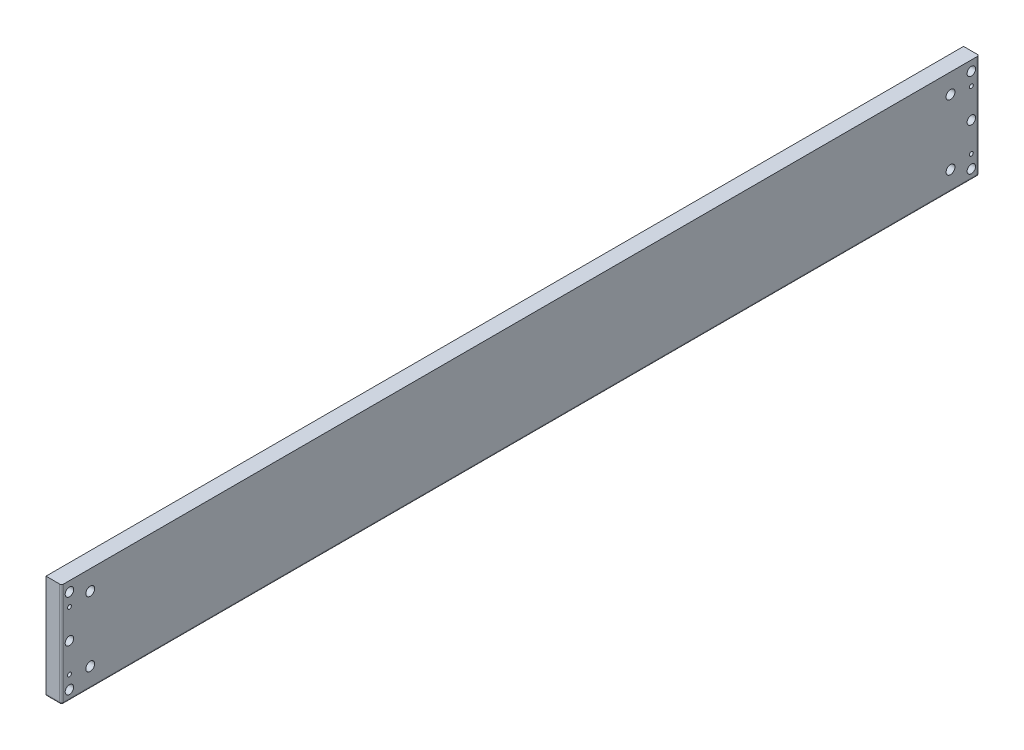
ISO-10303-21;
HEADER;
FILE_DESCRIPTION(('STEP AP214'),'2;1');
FILE_NAME('part.step','',(''),(''),'','','');
FILE_SCHEMA(('AUTOMOTIVE_DESIGN { 1 0 10303 214 1 1 1 1 }'));
ENDSEC;
DATA;
#1=APPLICATION_CONTEXT('core data for automotive mechanical design processes');
#2=APPLICATION_PROTOCOL_DEFINITION('international standard','automotive_design',2000,#1);
#3=PRODUCT_CONTEXT('',#1,'mechanical');
#4=PRODUCT('Part','Part','',(#3));
#5=PRODUCT_RELATED_PRODUCT_CATEGORY('part','',(#4));
#6=PRODUCT_DEFINITION_FORMATION('','',#4);
#7=PRODUCT_DEFINITION_CONTEXT('part definition',#1,'design');
#8=PRODUCT_DEFINITION('design','',#6,#7);
#9=PRODUCT_DEFINITION_SHAPE('','',#8);
#10=(LENGTH_UNIT() NAMED_UNIT(*) SI_UNIT(.MILLI.,.METRE.));
#11=(NAMED_UNIT(*) PLANE_ANGLE_UNIT() SI_UNIT($,.RADIAN.));
#12=(NAMED_UNIT(*) SI_UNIT($,.STERADIAN.) SOLID_ANGLE_UNIT());
#13=UNCERTAINTY_MEASURE_WITH_UNIT(LENGTH_MEASURE(1.E-05),#10,'distance_accuracy_value','');
#14=(GEOMETRIC_REPRESENTATION_CONTEXT(3) GLOBAL_UNCERTAINTY_ASSIGNED_CONTEXT((#13)) GLOBAL_UNIT_ASSIGNED_CONTEXT((#10,
#11,#12)) REPRESENTATION_CONTEXT('',''));
#15=CARTESIAN_POINT('',(0.,0.,0.));
#16=DIRECTION('',(0.,0.,1.));
#17=DIRECTION('',(1.,0.,0.));
#18=AXIS2_PLACEMENT_3D('',#15,#16,#17);
#19=CARTESIAN_POINT('',(4.50000000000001,-38.5,352.5));
#20=DIRECTION('',(0.,0.,-1.));
#21=DIRECTION('',(-1.,0.,0.));
#22=AXIS2_PLACEMENT_3D('',#19,#20,#21);
#23=CYLINDRICAL_SURFACE('',#22,1.5);
#24=CARTESIAN_POINT('',(4.50000000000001,-38.5,351.));
#25=DIRECTION('',(0.,0.,-1.));
#26=DIRECTION('',(1.,0.,0.));
#27=AXIS2_PLACEMENT_3D('',#24,#25,#26);
#28=CIRCLE('',#27,1.5);
#29=CARTESIAN_POINT('',(4.50000000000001,-40.,351.));
#30=VERTEX_POINT('',#29);
#31=CARTESIAN_POINT('',(6.00000000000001,-38.5,351.));
#32=VERTEX_POINT('',#31);
#33=EDGE_CURVE('E144',#30,#32,#28,.F.);
#34=ORIENTED_EDGE('',*,*,#33,.F.);
#35=DIRECTION('',(0.,0.,1.));
#36=VECTOR('',#35,1.);
#37=CARTESIAN_POINT('',(4.50000000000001,-40.,352.5));
#38=LINE('',#37,#36);
#39=CARTESIAN_POINT('',(4.50000000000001,-40.,-350.999999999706));
#40=VERTEX_POINT('',#39);
#41=EDGE_CURVE('E123',#30,#40,#38,.F.);
#42=ORIENTED_EDGE('',*,*,#41,.T.);
#43=CARTESIAN_POINT('',(4.50000000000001,-38.5,-351.));
#44=DIRECTION('',(0.,-7.85038884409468E-10,-1.));
#45=DIRECTION('',(1.,0.,0.));
#46=AXIS2_PLACEMENT_3D('',#43,#44,#45);
#47=CIRCLE('',#46,1.5);
#48=CARTESIAN_POINT('',(6.00000000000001,-38.5,-351.));
#49=VERTEX_POINT('',#48);
#50=EDGE_CURVE('E150',#49,#40,#47,.T.);
#51=ORIENTED_EDGE('',*,*,#50,.F.);
#52=DIRECTION('',(0.,0.,1.));
#53=VECTOR('',#52,1.);
#54=CARTESIAN_POINT('',(6.00000000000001,-38.5,352.5));
#55=LINE('',#54,#53);
#56=EDGE_CURVE('E145',#49,#32,#55,.T.);
#57=ORIENTED_EDGE('',*,*,#56,.T.);
#58=EDGE_LOOP('',(#34,#42,#51,#57));
#59=FACE_BOUND('',#58,.T.);
#60=ADVANCED_FACE('F16',(#59),#23,.T.);
#61=CARTESIAN_POINT('',(4.50000000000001,-38.5,351.));
#62=DIRECTION('',(1.,0.,0.));
#63=DIRECTION('',(0.,0.,-1.));
#64=AXIS2_PLACEMENT_3D('',#61,#62,#63);
#65=SPHERICAL_SURFACE('',#64,1.5);
#66=ORIENTED_EDGE('',*,*,#33,.T.);
#67=CARTESIAN_POINT('',(4.50000000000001,-38.5,351.));
#68=DIRECTION('',(0.,-1.,0.));
#69=DIRECTION('',(1.,0.,0.));
#70=AXIS2_PLACEMENT_3D('',#67,#68,#69);
#71=CIRCLE('',#70,1.5);
#72=CARTESIAN_POINT('',(4.50000000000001,-38.5,352.5));
#73=VERTEX_POINT('',#72);
#74=EDGE_CURVE('E153',#73,#32,#71,.F.);
#75=ORIENTED_EDGE('',*,*,#74,.F.);
#76=CARTESIAN_POINT('',(4.50000000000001,-38.5,351.));
#77=DIRECTION('',(-1.,0.,0.));
#78=DIRECTION('',(0.,0.,1.));
#79=AXIS2_PLACEMENT_3D('',#76,#77,#78);
#80=CIRCLE('',#79,1.5);
#81=EDGE_CURVE('E139',#30,#73,#80,.T.);
#82=ORIENTED_EDGE('',*,*,#81,.F.);
#83=EDGE_LOOP('',(#66,#75,#82));
#84=FACE_BOUND('',#83,.T.);
#85=ADVANCED_FACE('F152',(#84),#65,.T.);
#86=CARTESIAN_POINT('',(4.50000000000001,-38.5,-351.));
#87=DIRECTION('',(1.,0.,0.));
#88=DIRECTION('',(0.,0.,-1.));
#89=AXIS2_PLACEMENT_3D('',#86,#87,#88);
#90=SPHERICAL_SURFACE('',#89,1.5);
#91=CARTESIAN_POINT('',(4.50000000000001,-38.5,-351.));
#92=DIRECTION('',(0.,1.,0.));
#93=DIRECTION('',(-1.,0.,0.));
#94=AXIS2_PLACEMENT_3D('',#91,#92,#93);
#95=CIRCLE('',#94,1.5);
#96=CARTESIAN_POINT('',(4.50000000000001,-38.5,-352.5));
#97=VERTEX_POINT('',#96);
#98=EDGE_CURVE('E68',#49,#97,#95,.T.);
#99=ORIENTED_EDGE('',*,*,#98,.F.);
#100=ORIENTED_EDGE('',*,*,#50,.T.);
#101=CARTESIAN_POINT('',(4.50000000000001,-38.5,-351.));
#102=DIRECTION('',(1.,0.,0.));
#103=DIRECTION('',(0.,0.,-1.));
#104=AXIS2_PLACEMENT_3D('',#101,#102,#103);
#105=CIRCLE('',#104,1.5);
#106=EDGE_CURVE('E155',#97,#40,#105,.F.);
#107=ORIENTED_EDGE('',*,*,#106,.F.);
#108=EDGE_LOOP('',(#99,#100,#107));
#109=FACE_BOUND('',#108,.T.);
#110=ADVANCED_FACE('F211',(#109),#90,.T.);
#111=CARTESIAN_POINT('',(4.50000000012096,22.5,300.));
#112=DIRECTION('',(-1.,0.,0.));
#113=DIRECTION('',(0.,0.,1.));
#114=AXIS2_PLACEMENT_3D('',#111,#112,#113);
#115=CONICAL_SURFACE('',#114,1.64999999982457,1.04719755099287);
#116=CARTESIAN_POINT('',(5.45262794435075,22.5,299.999999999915));
#117=VERTEX_POINT('',#116);
#118=VERTEX_LOOP('',#117);
#119=FACE_BOUND('',#118,.T.);
#120=CARTESIAN_POINT('',(4.5,22.5,300.));
#121=DIRECTION('',(-1.,0.,0.));
#122=DIRECTION('',(0.,0.,1.));
#123=AXIS2_PLACEMENT_3D('',#120,#121,#122);
#124=CIRCLE('',#123,1.64999999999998);
#125=CARTESIAN_POINT('',(4.5,22.5,301.65));
#126=VERTEX_POINT('',#125);
#127=EDGE_CURVE('E203',#126,#126,#124,.T.);
#128=ORIENTED_EDGE('',*,*,#127,.T.);
#129=EDGE_LOOP('',(#128));
#130=FACE_BOUND('',#129,.T.);
#131=ADVANCED_FACE('F214',(#119,#130),#115,.F.);
#132=CARTESIAN_POINT('',(4.50000000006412,22.4999999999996,240.));
#133=DIRECTION('',(-1.,0.,0.));
#134=DIRECTION('',(0.,0.,1.));
#135=AXIS2_PLACEMENT_3D('',#132,#133,#134);
#136=CONICAL_SURFACE('',#135,1.64999999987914,1.04719755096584);
#137=CARTESIAN_POINT('',(5.45262794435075,22.4999999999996,239.999999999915));
#138=VERTEX_POINT('',#137);
#139=VERTEX_LOOP('',#138);
#140=FACE_BOUND('',#139,.T.);
#141=CARTESIAN_POINT('',(4.5,22.4999999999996,240.));
#142=DIRECTION('',(-1.,0.,0.));
#143=DIRECTION('',(0.,0.,1.));
#144=AXIS2_PLACEMENT_3D('',#141,#142,#143);
#145=CIRCLE('',#144,1.64999999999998);
#146=CARTESIAN_POINT('',(4.5,22.4999999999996,241.65));
#147=VERTEX_POINT('',#146);
#148=EDGE_CURVE('E200',#147,#147,#145,.T.);
#149=ORIENTED_EDGE('',*,*,#148,.T.);
#150=EDGE_LOOP('',(#149));
#151=FACE_BOUND('',#150,.T.);
#152=ADVANCED_FACE('F887',(#140,#151),#136,.F.);
#153=CARTESIAN_POINT('',(4.50000000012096,22.4999999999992,180.));
#154=DIRECTION('',(-1.,0.,0.));
#155=DIRECTION('',(0.,0.,1.));
#156=AXIS2_PLACEMENT_3D('',#153,#154,#155);
#157=CONICAL_SURFACE('',#156,1.64999999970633,1.04719755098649);
#158=CARTESIAN_POINT('',(5.45262794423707,22.4999999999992,180.000000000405));
#159=VERTEX_POINT('',#158);
#160=VERTEX_LOOP('',#159);
#161=FACE_BOUND('',#160,.T.);
#162=CARTESIAN_POINT('',(4.5,22.4999999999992,180.));
#163=DIRECTION('',(-1.,0.,0.));
#164=DIRECTION('',(0.,0.,1.));
#165=AXIS2_PLACEMENT_3D('',#162,#163,#164);
#166=CIRCLE('',#165,1.64999999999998);
#167=CARTESIAN_POINT('',(4.5,22.4999999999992,181.65));
#168=VERTEX_POINT('',#167);
#169=EDGE_CURVE('E197',#168,#168,#166,.T.);
#170=ORIENTED_EDGE('',*,*,#169,.T.);
#171=EDGE_LOOP('',(#170));
#172=FACE_BOUND('',#171,.T.);
#173=ADVANCED_FACE('F878',(#161,#172),#157,.F.);
#174=CARTESIAN_POINT('',(4.50000000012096,22.4999999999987,120.));
#175=DIRECTION('',(-1.,0.,0.));
#176=DIRECTION('',(0.,0.,1.));
#177=AXIS2_PLACEMENT_3D('',#174,#175,#176);
#178=CONICAL_SURFACE('',#177,1.64999999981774,1.04719755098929);
#179=CARTESIAN_POINT('',(5.45262794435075,22.4999999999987,119.999999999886));
#180=VERTEX_POINT('',#179);
#181=VERTEX_LOOP('',#180);
#182=FACE_BOUND('',#181,.T.);
#183=CARTESIAN_POINT('',(4.5,22.4999999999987,120.));
#184=DIRECTION('',(-1.,0.,0.));
#185=DIRECTION('',(0.,0.,1.));
#186=AXIS2_PLACEMENT_3D('',#183,#184,#185);
#187=CIRCLE('',#186,1.64999999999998);
#188=CARTESIAN_POINT('',(4.5,22.4999999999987,121.65));
#189=VERTEX_POINT('',#188);
#190=EDGE_CURVE('E194',#189,#189,#187,.T.);
#191=ORIENTED_EDGE('',*,*,#190,.T.);
#192=EDGE_LOOP('',(#191));
#193=FACE_BOUND('',#192,.T.);
#194=ADVANCED_FACE('F869',(#182,#193),#178,.F.);
#195=CARTESIAN_POINT('',(4.50000000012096,22.4999999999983,60.));
#196=DIRECTION('',(-1.,0.,0.));
#197=DIRECTION('',(0.,0.,1.));
#198=AXIS2_PLACEMENT_3D('',#195,#196,#197);
#199=CONICAL_SURFACE('',#198,1.64999999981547,1.04719755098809);
#200=CARTESIAN_POINT('',(5.45262794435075,22.4999999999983,59.9999999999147));
#201=VERTEX_POINT('',#200);
#202=VERTEX_LOOP('',#201);
#203=FACE_BOUND('',#202,.T.);
#204=CARTESIAN_POINT('',(4.5,22.4999999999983,60.));
#205=DIRECTION('',(-1.,0.,0.));
#206=DIRECTION('',(0.,0.,1.));
#207=AXIS2_PLACEMENT_3D('',#204,#205,#206);
#208=CIRCLE('',#207,1.64999999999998);
#209=CARTESIAN_POINT('',(4.5,22.4999999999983,61.65));
#210=VERTEX_POINT('',#209);
#211=EDGE_CURVE('E191',#210,#210,#208,.T.);
#212=ORIENTED_EDGE('',*,*,#211,.T.);
#213=EDGE_LOOP('',(#212));
#214=FACE_BOUND('',#213,.T.);
#215=ADVANCED_FACE('F860',(#203,#214),#199,.F.);
#216=CARTESIAN_POINT('',(4.50000000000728,22.4999999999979,0.));
#217=DIRECTION('',(-1.,0.,0.));
#218=DIRECTION('',(0.,0.,1.));
#219=AXIS2_PLACEMENT_3D('',#216,#217,#218);
#220=CONICAL_SURFACE('',#219,1.64999999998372,1.04719755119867);
#221=CARTESIAN_POINT('',(5.45262794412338,22.4999999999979,0.));
#222=VERTEX_POINT('',#221);
#223=VERTEX_LOOP('',#222);
#224=FACE_BOUND('',#223,.T.);
#225=CARTESIAN_POINT('',(4.5,22.4999999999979,0.));
#226=DIRECTION('',(-1.,0.,0.));
#227=DIRECTION('',(0.,0.,1.));
#228=AXIS2_PLACEMENT_3D('',#225,#226,#227);
#229=CIRCLE('',#228,1.64999999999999);
#230=CARTESIAN_POINT('',(4.5,22.4999999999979,1.64999999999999));
#231=VERTEX_POINT('',#230);
#232=EDGE_CURVE('E188',#231,#231,#229,.T.);
#233=ORIENTED_EDGE('',*,*,#232,.T.);
#234=EDGE_LOOP('',(#233));
#235=FACE_BOUND('',#234,.T.);
#236=ADVANCED_FACE('F851',(#224,#235),#220,.F.);
#237=CARTESIAN_POINT('',(4.50000000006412,22.4999999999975,-60.));
#238=DIRECTION('',(-1.,0.,0.));
#239=DIRECTION('',(0.,0.,1.));
#240=AXIS2_PLACEMENT_3D('',#237,#238,#239);
#241=CONICAL_SURFACE('',#240,1.64999999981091,1.04719755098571);
#242=CARTESIAN_POINT('',(5.45262794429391,22.4999999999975,-60.0000000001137));
#243=VERTEX_POINT('',#242);
#244=VERTEX_LOOP('',#243);
#245=FACE_BOUND('',#244,.T.);
#246=CARTESIAN_POINT('',(4.5,22.4999999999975,-60.));
#247=DIRECTION('',(-1.,0.,0.));
#248=DIRECTION('',(0.,0.,1.));
#249=AXIS2_PLACEMENT_3D('',#246,#247,#248);
#250=CIRCLE('',#249,1.64999999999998);
#251=CARTESIAN_POINT('',(4.5,22.4999999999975,-58.35));
#252=VERTEX_POINT('',#251);
#253=EDGE_CURVE('E185',#252,#252,#250,.T.);
#254=ORIENTED_EDGE('',*,*,#253,.T.);
#255=EDGE_LOOP('',(#254));
#256=FACE_BOUND('',#255,.T.);
#257=ADVANCED_FACE('F842',(#245,#256),#241,.F.);
#258=CARTESIAN_POINT('',(4.50000000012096,22.4999999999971,-120.));
#259=DIRECTION('',(-1.,0.,0.));
#260=DIRECTION('',(0.,0.,1.));
#261=AXIS2_PLACEMENT_3D('',#258,#259,#260);
#262=CONICAL_SURFACE('',#261,1.64999999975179,1.04719755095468);
#263=CARTESIAN_POINT('',(5.45262794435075,22.4999999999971,-120.000000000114));
#264=VERTEX_POINT('',#263);
#265=VERTEX_LOOP('',#264);
#266=FACE_BOUND('',#265,.T.);
#267=CARTESIAN_POINT('',(4.5,22.4999999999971,-120.));
#268=DIRECTION('',(-1.,0.,0.));
#269=DIRECTION('',(0.,0.,1.));
#270=AXIS2_PLACEMENT_3D('',#267,#268,#269);
#271=CIRCLE('',#270,1.64999999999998);
#272=CARTESIAN_POINT('',(4.5,22.4999999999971,-118.35));
#273=VERTEX_POINT('',#272);
#274=EDGE_CURVE('E182',#273,#273,#271,.T.);
#275=ORIENTED_EDGE('',*,*,#274,.T.);
#276=EDGE_LOOP('',(#275));
#277=FACE_BOUND('',#276,.T.);
#278=ADVANCED_FACE('F833',(#266,#277),#262,.F.);
#279=CARTESIAN_POINT('',(4.50000000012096,22.4999999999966,-180.));
#280=DIRECTION('',(-1.,0.,0.));
#281=DIRECTION('',(0.,0.,1.));
#282=AXIS2_PLACEMENT_3D('',#279,#280,#281);
#283=CONICAL_SURFACE('',#282,1.64999999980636,1.04719755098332);
#284=CARTESIAN_POINT('',(5.45262794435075,22.4999999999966,-180.000000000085));
#285=VERTEX_POINT('',#284);
#286=VERTEX_LOOP('',#285);
#287=FACE_BOUND('',#286,.T.);
#288=CARTESIAN_POINT('',(4.5,22.4999999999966,-180.));
#289=DIRECTION('',(-1.,0.,0.));
#290=DIRECTION('',(0.,0.,1.));
#291=AXIS2_PLACEMENT_3D('',#288,#289,#290);
#292=CIRCLE('',#291,1.64999999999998);
#293=CARTESIAN_POINT('',(4.5,22.4999999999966,-178.35));
#294=VERTEX_POINT('',#293);
#295=EDGE_CURVE('E179',#294,#294,#292,.T.);
#296=ORIENTED_EDGE('',*,*,#295,.T.);
#297=EDGE_LOOP('',(#296));
#298=FACE_BOUND('',#297,.T.);
#299=ADVANCED_FACE('F824',(#287,#298),#283,.F.);
#300=CARTESIAN_POINT('',(4.50000000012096,22.4999999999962,-240.));
#301=DIRECTION('',(-1.,0.,0.));
#302=DIRECTION('',(0.,0.,1.));
#303=AXIS2_PLACEMENT_3D('',#300,#301,#302);
#304=CONICAL_SURFACE('',#303,1.64999999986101,1.04719755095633);
#305=CARTESIAN_POINT('',(5.4526279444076,22.4999999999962,-240.000000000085));
#306=VERTEX_POINT('',#305);
#307=VERTEX_LOOP('',#306);
#308=FACE_BOUND('',#307,.T.);
#309=CARTESIAN_POINT('',(4.5,22.4999999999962,-240.));
#310=DIRECTION('',(-1.,0.,0.));
#311=DIRECTION('',(0.,0.,1.));
#312=AXIS2_PLACEMENT_3D('',#309,#310,#311);
#313=CIRCLE('',#312,1.64999999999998);
#314=CARTESIAN_POINT('',(4.5,22.4999999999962,-238.35));
#315=VERTEX_POINT('',#314);
#316=EDGE_CURVE('E176',#315,#315,#313,.T.);
#317=ORIENTED_EDGE('',*,*,#316,.T.);
#318=EDGE_LOOP('',(#317));
#319=FACE_BOUND('',#318,.T.);
#320=ADVANCED_FACE('F815',(#308,#319),#304,.F.);
#321=CARTESIAN_POINT('',(4.50000000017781,22.4999999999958,-300.));
#322=DIRECTION('',(-1.,0.,0.));
#323=DIRECTION('',(0.,0.,1.));
#324=AXIS2_PLACEMENT_3D('',#321,#322,#323);
#325=CONICAL_SURFACE('',#324,1.64999999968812,1.04719755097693);
#326=CARTESIAN_POINT('',(5.45262794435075,22.4999999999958,-300.000000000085));
#327=VERTEX_POINT('',#326);
#328=VERTEX_LOOP('',#327);
#329=FACE_BOUND('',#328,.T.);
#330=CARTESIAN_POINT('',(4.5,22.4999999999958,-300.));
#331=DIRECTION('',(-1.,0.,0.));
#332=DIRECTION('',(0.,0.,1.));
#333=AXIS2_PLACEMENT_3D('',#330,#331,#332);
#334=CIRCLE('',#333,1.64999999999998);
#335=CARTESIAN_POINT('',(4.5,22.4999999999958,-298.35));
#336=VERTEX_POINT('',#335);
#337=EDGE_CURVE('E172',#336,#336,#334,.T.);
#338=ORIENTED_EDGE('',*,*,#337,.T.);
#339=EDGE_LOOP('',(#338));
#340=FACE_BOUND('',#339,.T.);
#341=ADVANCED_FACE('F806',(#329,#340),#325,.F.);
#342=CARTESIAN_POINT('',(6.,40.,352.5));
#343=DIRECTION('',(-1.,0.,0.));
#344=DIRECTION('',(0.,-1.,0.));
#345=AXIS2_PLACEMENT_3D('',#342,#343,#344);
#346=PLANE('',#345);
#347=CARTESIAN_POINT('',(6.00000000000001,32.5,-346.5));
#348=DIRECTION('',(-1.,0.,0.));
#349=DIRECTION('',(0.,-1.,0.));
#350=AXIS2_PLACEMENT_3D('',#347,#348,#349);
#351=CIRCLE('',#350,3.24999999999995);
#352=CARTESIAN_POINT('',(6.00000000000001,29.25,-346.5));
#353=VERTEX_POINT('',#352);
#354=EDGE_CURVE('E314',#353,#353,#351,.T.);
#355=ORIENTED_EDGE('',*,*,#354,.T.);
#356=EDGE_LOOP('',(#355));
#357=FACE_BOUND('',#356,.T.);
#358=CARTESIAN_POINT('',(6.00000000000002,-32.5,-346.5));
#359=DIRECTION('',(-1.,0.,0.));
#360=DIRECTION('',(0.,-1.,0.));
#361=AXIS2_PLACEMENT_3D('',#358,#359,#360);
#362=CIRCLE('',#361,3.24999999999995);
#363=CARTESIAN_POINT('',(6.00000000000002,-35.75,-346.5));
#364=VERTEX_POINT('',#363);
#365=EDGE_CURVE('E317',#364,#364,#362,.T.);
#366=ORIENTED_EDGE('',*,*,#365,.T.);
#367=EDGE_LOOP('',(#366));
#368=FACE_BOUND('',#367,.T.);
#369=CARTESIAN_POINT('',(6.00000000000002,-32.4999999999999,346.5));
#370=DIRECTION('',(-1.,0.,0.));
#371=DIRECTION('',(0.,-1.,0.));
#372=AXIS2_PLACEMENT_3D('',#369,#370,#371);
#373=CIRCLE('',#372,3.24999999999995);
#374=CARTESIAN_POINT('',(6.00000000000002,-35.7499999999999,346.5));
#375=VERTEX_POINT('',#374);
#376=EDGE_CURVE('E320',#375,#375,#373,.T.);
#377=ORIENTED_EDGE('',*,*,#376,.T.);
#378=EDGE_LOOP('',(#377));
#379=FACE_BOUND('',#378,.T.);
#380=CARTESIAN_POINT('',(6.00000000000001,32.4999999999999,346.5));
#381=DIRECTION('',(-1.,0.,0.));
#382=DIRECTION('',(0.,-1.,0.));
#383=AXIS2_PLACEMENT_3D('',#380,#381,#382);
#384=CIRCLE('',#383,3.24999999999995);
#385=CARTESIAN_POINT('',(6.00000000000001,29.25,346.5));
#386=VERTEX_POINT('',#385);
#387=EDGE_CURVE('E323',#386,#386,#384,.T.);
#388=ORIENTED_EDGE('',*,*,#387,.T.);
#389=EDGE_LOOP('',(#388));
#390=FACE_BOUND('',#389,.T.);
#391=CARTESIAN_POINT('',(6.00000000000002,0.,-346.5));
#392=DIRECTION('',(-1.,0.,0.));
#393=DIRECTION('',(0.,-1.,0.));
#394=AXIS2_PLACEMENT_3D('',#391,#392,#393);
#395=CIRCLE('',#394,3.24999999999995);
#396=CARTESIAN_POINT('',(6.00000000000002,-3.24999999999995,-346.5));
#397=VERTEX_POINT('',#396);
#398=EDGE_CURVE('E326',#397,#397,#395,.T.);
#399=ORIENTED_EDGE('',*,*,#398,.T.);
#400=EDGE_LOOP('',(#399));
#401=FACE_BOUND('',#400,.T.);
#402=CARTESIAN_POINT('',(6.00000000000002,0.,346.5));
#403=DIRECTION('',(-1.,0.,0.));
#404=DIRECTION('',(0.,-1.,0.));
#405=AXIS2_PLACEMENT_3D('',#402,#403,#404);
#406=CIRCLE('',#405,3.24999999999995);
#407=CARTESIAN_POINT('',(6.00000000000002,-3.24999999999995,346.5));
#408=VERTEX_POINT('',#407);
#409=EDGE_CURVE('E329',#408,#408,#406,.T.);
#410=ORIENTED_EDGE('',*,*,#409,.T.);
#411=EDGE_LOOP('',(#410));
#412=FACE_BOUND('',#411,.T.);
#413=DIRECTION('',(0.,-1.,0.));
#414=VECTOR('',#413,1.);
#415=CARTESIAN_POINT('',(6.00000000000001,-40.,351.));
#416=LINE('',#415,#414);
#417=CARTESIAN_POINT('',(6.,40.,351.));
#418=VERTEX_POINT('',#417);
#419=EDGE_CURVE('E133',#32,#418,#416,.F.);
#420=ORIENTED_EDGE('',*,*,#419,.F.);
#421=ORIENTED_EDGE('',*,*,#56,.F.);
#422=DIRECTION('',(0.,1.,0.));
#423=VECTOR('',#422,1.);
#424=CARTESIAN_POINT('',(6.,40.,-351.));
#425=LINE('',#424,#423);
#426=CARTESIAN_POINT('',(6.,40.,-351.));
#427=VERTEX_POINT('',#426);
#428=EDGE_CURVE('E168',#427,#49,#425,.F.);
#429=ORIENTED_EDGE('',*,*,#428,.F.);
#430=DIRECTION('',(0.,0.,-1.));
#431=VECTOR('',#430,1.);
#432=CARTESIAN_POINT('',(6.,40.,352.5));
#433=LINE('',#432,#431);
#434=EDGE_CURVE('E312',#427,#418,#433,.F.);
#435=ORIENTED_EDGE('',*,*,#434,.T.);
#436=EDGE_LOOP('',(#420,#421,#429,#435));
#437=FACE_BOUND('',#436,.T.);
#438=CARTESIAN_POINT('',(6.00000000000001,-25.,330.5));
#439=DIRECTION('',(1.,0.,0.));
#440=DIRECTION('',(0.,0.,-1.));
#441=AXIS2_PLACEMENT_3D('',#438,#439,#440);
#442=CIRCLE('',#441,3.40000000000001);
#443=CARTESIAN_POINT('',(6.00000000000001,-25.,327.1));
#444=VERTEX_POINT('',#443);
#445=EDGE_CURVE('E332',#444,#444,#442,.F.);
#446=ORIENTED_EDGE('',*,*,#445,.T.);
#447=EDGE_LOOP('',(#446));
#448=FACE_BOUND('',#447,.T.);
#449=CARTESIAN_POINT('',(6.,25.,330.5));
#450=DIRECTION('',(1.,0.,0.));
#451=DIRECTION('',(0.,0.,-1.));
#452=AXIS2_PLACEMENT_3D('',#449,#450,#451);
#453=CIRCLE('',#452,3.40000000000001);
#454=CARTESIAN_POINT('',(6.,25.,327.1));
#455=VERTEX_POINT('',#454);
#456=EDGE_CURVE('E335',#455,#455,#453,.F.);
#457=ORIENTED_EDGE('',*,*,#456,.T.);
#458=EDGE_LOOP('',(#457));
#459=FACE_BOUND('',#458,.T.);
#460=CARTESIAN_POINT('',(6.,25.,-330.5));
#461=DIRECTION('',(1.,0.,0.));
#462=DIRECTION('',(0.,0.,-1.));
#463=AXIS2_PLACEMENT_3D('',#460,#461,#462);
#464=CIRCLE('',#463,3.40000000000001);
#465=CARTESIAN_POINT('',(6.,25.,-333.9));
#466=VERTEX_POINT('',#465);
#467=EDGE_CURVE('E338',#466,#466,#464,.F.);
#468=ORIENTED_EDGE('',*,*,#467,.T.);
#469=EDGE_LOOP('',(#468));
#470=FACE_BOUND('',#469,.T.);
#471=CARTESIAN_POINT('',(6.00000000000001,-25.,-330.5));
#472=DIRECTION('',(1.,0.,0.));
#473=DIRECTION('',(0.,0.,-1.));
#474=AXIS2_PLACEMENT_3D('',#471,#472,#473);
#475=CIRCLE('',#474,3.40000000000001);
#476=CARTESIAN_POINT('',(6.00000000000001,-25.,-333.9));
#477=VERTEX_POINT('',#476);
#478=EDGE_CURVE('E175',#477,#477,#475,.F.);
#479=ORIENTED_EDGE('',*,*,#478,.T.);
#480=EDGE_LOOP('',(#479));
#481=FACE_BOUND('',#480,.T.);
#482=CARTESIAN_POINT('',(6.,22.5,346.5));
#483=DIRECTION('',(1.,0.,0.));
#484=DIRECTION('',(0.,1.,0.));
#485=AXIS2_PLACEMENT_3D('',#482,#483,#484);
#486=CIRCLE('',#485,1.50000000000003);
#487=CARTESIAN_POINT('',(6.,24.,346.5));
#488=VERTEX_POINT('',#487);
#489=EDGE_CURVE('E206',#488,#488,#486,.F.);
#490=ORIENTED_EDGE('',*,*,#489,.T.);
#491=EDGE_LOOP('',(#490));
#492=FACE_BOUND('',#491,.T.);
#493=CARTESIAN_POINT('',(6.00000000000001,-22.5,346.5));
#494=DIRECTION('',(1.,0.,0.));
#495=DIRECTION('',(0.,1.,0.));
#496=AXIS2_PLACEMENT_3D('',#493,#494,#495);
#497=CIRCLE('',#496,1.50000000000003);
#498=CARTESIAN_POINT('',(6.00000000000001,-21.,346.5));
#499=VERTEX_POINT('',#498);
#500=EDGE_CURVE('E345',#499,#499,#497,.F.);
#501=ORIENTED_EDGE('',*,*,#500,.T.);
#502=EDGE_LOOP('',(#501));
#503=FACE_BOUND('',#502,.T.);
#504=CARTESIAN_POINT('',(6.00000000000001,-22.5,-346.5));
#505=DIRECTION('',(1.,0.,0.));
#506=DIRECTION('',(0.,1.,0.));
#507=AXIS2_PLACEMENT_3D('',#504,#505,#506);
#508=CIRCLE('',#507,1.50000000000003);
#509=CARTESIAN_POINT('',(6.00000000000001,-21.,-346.5));
#510=VERTEX_POINT('',#509);
#511=EDGE_CURVE('E347',#510,#510,#508,.F.);
#512=ORIENTED_EDGE('',*,*,#511,.T.);
#513=EDGE_LOOP('',(#512));
#514=FACE_BOUND('',#513,.T.);
#515=CARTESIAN_POINT('',(6.,22.5,-346.5));
#516=DIRECTION('',(1.,0.,0.));
#517=DIRECTION('',(0.,1.,0.));
#518=AXIS2_PLACEMENT_3D('',#515,#516,#517);
#519=CIRCLE('',#518,1.50000000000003);
#520=CARTESIAN_POINT('',(6.,24.,-346.5));
#521=VERTEX_POINT('',#520);
#522=EDGE_CURVE('E19',#521,#521,#519,.F.);
#523=ORIENTED_EDGE('',*,*,#522,.T.);
#524=EDGE_LOOP('',(#523));
#525=FACE_BOUND('',#524,.T.);
#526=ADVANCED_FACE('F424',(#357,#368,#379,#390,#401,#412,#437,#448,#459,#470,#481,#492,#503,
#514,#525),#346,.F.);
#527=CARTESIAN_POINT('',(4.50000000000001,-40.,351.));
#528=DIRECTION('',(0.,-1.,0.));
#529=DIRECTION('',(1.,0.,0.));
#530=AXIS2_PLACEMENT_3D('',#527,#528,#529);
#531=CYLINDRICAL_SURFACE('',#530,1.5);
#532=CARTESIAN_POINT('',(4.5,40.,351.));
#533=DIRECTION('',(0.,-1.,0.));
#534=DIRECTION('',(1.,0.,0.));
#535=AXIS2_PLACEMENT_3D('',#532,#533,#534);
#536=CIRCLE('',#535,1.5);
#537=CARTESIAN_POINT('',(4.5,40.,352.5));
#538=VERTEX_POINT('',#537);
#539=EDGE_CURVE('E308',#418,#538,#536,.T.);
#540=ORIENTED_EDGE('',*,*,#539,.T.);
#541=DIRECTION('',(0.,1.,0.));
#542=VECTOR('',#541,1.);
#543=CARTESIAN_POINT('',(4.50000000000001,-40.,352.5));
#544=LINE('',#543,#542);
#545=EDGE_CURVE('E368',#73,#538,#544,.T.);
#546=ORIENTED_EDGE('',*,*,#545,.F.);
#547=ORIENTED_EDGE('',*,*,#74,.T.);
#548=ORIENTED_EDGE('',*,*,#419,.T.);
#549=EDGE_LOOP('',(#540,#546,#547,#548));
#550=FACE_BOUND('',#549,.T.);
#551=ADVANCED_FACE('F791',(#550),#531,.T.);
#552=CARTESIAN_POINT('',(-5.99999999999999,-40.,352.5));
#553=DIRECTION('',(0.,1.,0.));
#554=DIRECTION('',(0.,0.,1.));
#555=AXIS2_PLACEMENT_3D('',#552,#553,#554);
#556=PLANE('',#555);
#557=DIRECTION('',(0.,0.,-1.));
#558=VECTOR('',#557,1.);
#559=CARTESIAN_POINT('',(-4.49999999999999,-40.,352.5));
#560=LINE('',#559,#558);
#561=CARTESIAN_POINT('',(-4.49999999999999,-40.,-351.));
#562=VERTEX_POINT('',#561);
#563=CARTESIAN_POINT('',(-4.49999999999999,-40.,351.));
#564=VERTEX_POINT('',#563);
#565=EDGE_CURVE('E303',#562,#564,#560,.F.);
#566=ORIENTED_EDGE('',*,*,#565,.F.);
#567=DIRECTION('',(1.,0.,0.));
#568=VECTOR('',#567,1.);
#569=CARTESIAN_POINT('',(-5.99999999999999,-40.,-351.));
#570=LINE('',#569,#568);
#571=EDGE_CURVE('E129',#40,#562,#570,.F.);
#572=ORIENTED_EDGE('',*,*,#571,.F.);
#573=ORIENTED_EDGE('',*,*,#41,.F.);
#574=DIRECTION('',(-1.,0.,0.));
#575=VECTOR('',#574,1.);
#576=CARTESIAN_POINT('',(-5.99999999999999,-40.,351.));
#577=LINE('',#576,#575);
#578=EDGE_CURVE('E127',#564,#30,#577,.F.);
#579=ORIENTED_EDGE('',*,*,#578,.F.);
#580=EDGE_LOOP('',(#566,#572,#573,#579));
#581=FACE_BOUND('',#580,.T.);
#582=ADVANCED_FACE('F126',(#581),#556,.F.);
#583=CARTESIAN_POINT('',(-5.99999999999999,-38.5,351.));
#584=DIRECTION('',(-1.,0.,0.));
#585=DIRECTION('',(0.,0.,1.));
#586=AXIS2_PLACEMENT_3D('',#583,#584,#585);
#587=CYLINDRICAL_SURFACE('',#586,1.5);
#588=ORIENTED_EDGE('',*,*,#81,.T.);
#589=DIRECTION('',(1.,0.,0.));
#590=VECTOR('',#589,1.);
#591=CARTESIAN_POINT('',(-5.99999999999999,-38.5,352.5));
#592=LINE('',#591,#590);
#593=CARTESIAN_POINT('',(-5.99999999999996,-38.5,352.5));
#594=VERTEX_POINT('',#593);
#595=EDGE_CURVE('E311',#594,#73,#592,.T.);
#596=ORIENTED_EDGE('',*,*,#595,.F.);
#597=CARTESIAN_POINT('',(-4.49999999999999,-38.5,351.));
#598=DIRECTION('',(-0.707106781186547,0.,-0.707106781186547));
#599=DIRECTION('',(0.707106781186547,0.,-0.707106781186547));
#600=AXIS2_PLACEMENT_3D('',#597,#598,#599);
#601=ELLIPSE('',#600,2.12132034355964,1.5);
#602=EDGE_CURVE('E141',#564,#594,#601,.T.);
#603=ORIENTED_EDGE('',*,*,#602,.F.);
#604=ORIENTED_EDGE('',*,*,#578,.T.);
#605=EDGE_LOOP('',(#588,#596,#603,#604));
#606=FACE_BOUND('',#605,.T.);
#607=ADVANCED_FACE('F136',(#606),#587,.T.);
#608=CARTESIAN_POINT('',(-5.99999999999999,-38.5,-351.));
#609=DIRECTION('',(1.,0.,0.));
#610=DIRECTION('',(0.,0.,-1.));
#611=AXIS2_PLACEMENT_3D('',#608,#609,#610);
#612=CYLINDRICAL_SURFACE('',#611,1.5);
#613=ORIENTED_EDGE('',*,*,#106,.T.);
#614=ORIENTED_EDGE('',*,*,#571,.T.);
#615=CARTESIAN_POINT('',(-4.49999999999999,-38.5,-351.));
#616=DIRECTION('',(0.707106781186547,0.,-0.707106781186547));
#617=DIRECTION('',(-0.707106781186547,0.,-0.707106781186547));
#618=AXIS2_PLACEMENT_3D('',#615,#616,#617);
#619=ELLIPSE('',#618,2.12132034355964,1.5);
#620=CARTESIAN_POINT('',(-5.99999999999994,-38.5,-352.5));
#621=VERTEX_POINT('',#620);
#622=EDGE_CURVE('E304',#621,#562,#619,.F.);
#623=ORIENTED_EDGE('',*,*,#622,.F.);
#624=DIRECTION('',(1.,0.,0.));
#625=VECTOR('',#624,1.);
#626=CARTESIAN_POINT('',(-5.99999999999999,-38.5,-352.5));
#627=LINE('',#626,#625);
#628=EDGE_CURVE('E33',#621,#97,#627,.T.);
#629=ORIENTED_EDGE('',*,*,#628,.T.);
#630=EDGE_LOOP('',(#613,#614,#623,#629));
#631=FACE_BOUND('',#630,.T.);
#632=ADVANCED_FACE('F377',(#631),#612,.T.);
#633=CARTESIAN_POINT('',(4.5,40.,-351.));
#634=DIRECTION('',(0.,1.,0.));
#635=DIRECTION('',(-1.,0.,0.));
#636=AXIS2_PLACEMENT_3D('',#633,#634,#635);
#637=CYLINDRICAL_SURFACE('',#636,1.5);
#638=ORIENTED_EDGE('',*,*,#98,.T.);
#639=DIRECTION('',(0.,1.,0.));
#640=VECTOR('',#639,1.);
#641=CARTESIAN_POINT('',(4.50000000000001,-40.,-352.5));
#642=LINE('',#641,#640);
#643=CARTESIAN_POINT('',(4.5,40.,-352.5));
#644=VERTEX_POINT('',#643);
#645=EDGE_CURVE('E379',#97,#644,#642,.T.);
#646=ORIENTED_EDGE('',*,*,#645,.T.);
#647=CARTESIAN_POINT('',(4.5,40.,-351.));
#648=DIRECTION('',(0.,1.,0.));
#649=DIRECTION('',(-1.,0.,0.));
#650=AXIS2_PLACEMENT_3D('',#647,#648,#649);
#651=CIRCLE('',#650,1.5);
#652=EDGE_CURVE('E58',#644,#427,#651,.F.);
#653=ORIENTED_EDGE('',*,*,#652,.T.);
#654=ORIENTED_EDGE('',*,*,#428,.T.);
#655=EDGE_LOOP('',(#638,#646,#653,#654));
#656=FACE_BOUND('',#655,.T.);
#657=ADVANCED_FACE('F426',(#656),#637,.T.);
#658=CARTESIAN_POINT('',(-6.00000000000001,22.5,-346.5));
#659=DIRECTION('',(1.,0.,0.));
#660=DIRECTION('',(0.,1.,0.));
#661=AXIS2_PLACEMENT_3D('',#658,#659,#660);
#662=CYLINDRICAL_SURFACE('',#661,1.50000000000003);
#663=CARTESIAN_POINT('',(-6.00000000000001,22.5,-346.5));
#664=DIRECTION('',(1.,0.,0.));
#665=DIRECTION('',(0.,1.,0.));
#666=AXIS2_PLACEMENT_3D('',#663,#664,#665);
#667=CIRCLE('',#666,1.50000000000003);
#668=CARTESIAN_POINT('',(-6.00000000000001,24.,-346.5));
#669=VERTEX_POINT('',#668);
#670=EDGE_CURVE('E298',#669,#669,#667,.F.);
#671=ORIENTED_EDGE('',*,*,#670,.T.);
#672=EDGE_LOOP('',(#671));
#673=FACE_BOUND('',#672,.T.);
#674=ORIENTED_EDGE('',*,*,#522,.F.);
#675=EDGE_LOOP('',(#674));
#676=FACE_BOUND('',#675,.T.);
#677=ADVANCED_FACE('F428',(#673,#676),#662,.F.);
#678=CARTESIAN_POINT('',(-6.,-22.5,-346.5));
#679=DIRECTION('',(1.,0.,0.));
#680=DIRECTION('',(0.,1.,0.));
#681=AXIS2_PLACEMENT_3D('',#678,#679,#680);
#682=CYLINDRICAL_SURFACE('',#681,1.50000000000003);
#683=CARTESIAN_POINT('',(-6.,-22.5,-346.5));
#684=DIRECTION('',(1.,0.,0.));
#685=DIRECTION('',(0.,1.,0.));
#686=AXIS2_PLACEMENT_3D('',#683,#684,#685);
#687=CIRCLE('',#686,1.50000000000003);
#688=CARTESIAN_POINT('',(-6.,-21.,-346.5));
#689=VERTEX_POINT('',#688);
#690=EDGE_CURVE('E295',#689,#689,#687,.F.);
#691=ORIENTED_EDGE('',*,*,#690,.T.);
#692=EDGE_LOOP('',(#691));
#693=FACE_BOUND('',#692,.T.);
#694=ORIENTED_EDGE('',*,*,#511,.F.);
#695=EDGE_LOOP('',(#694));
#696=FACE_BOUND('',#695,.T.);
#697=ADVANCED_FACE('F435',(#693,#696),#682,.F.);
#698=CARTESIAN_POINT('',(-6.,-22.5,346.5));
#699=DIRECTION('',(1.,0.,0.));
#700=DIRECTION('',(0.,1.,0.));
#701=AXIS2_PLACEMENT_3D('',#698,#699,#700);
#702=CYLINDRICAL_SURFACE('',#701,1.50000000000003);
#703=CARTESIAN_POINT('',(-6.,-22.5,346.5));
#704=DIRECTION('',(1.,0.,0.));
#705=DIRECTION('',(0.,1.,0.));
#706=AXIS2_PLACEMENT_3D('',#703,#704,#705);
#707=CIRCLE('',#706,1.50000000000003);
#708=CARTESIAN_POINT('',(-6.,-21.,346.5));
#709=VERTEX_POINT('',#708);
#710=EDGE_CURVE('E292',#709,#709,#707,.F.);
#711=ORIENTED_EDGE('',*,*,#710,.T.);
#712=EDGE_LOOP('',(#711));
#713=FACE_BOUND('',#712,.T.);
#714=ORIENTED_EDGE('',*,*,#500,.F.);
#715=EDGE_LOOP('',(#714));
#716=FACE_BOUND('',#715,.T.);
#717=ADVANCED_FACE('F539',(#713,#716),#702,.F.);
#718=CARTESIAN_POINT('',(-6.00000000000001,22.5,346.5));
#719=DIRECTION('',(1.,0.,0.));
#720=DIRECTION('',(0.,1.,0.));
#721=AXIS2_PLACEMENT_3D('',#718,#719,#720);
#722=CYLINDRICAL_SURFACE('',#721,1.50000000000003);
#723=CARTESIAN_POINT('',(-6.00000000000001,22.5,346.5));
#724=DIRECTION('',(1.,0.,0.));
#725=DIRECTION('',(0.,1.,0.));
#726=AXIS2_PLACEMENT_3D('',#723,#724,#725);
#727=CIRCLE('',#726,1.50000000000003);
#728=CARTESIAN_POINT('',(-6.00000000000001,24.,346.5));
#729=VERTEX_POINT('',#728);
#730=EDGE_CURVE('E289',#729,#729,#727,.F.);
#731=ORIENTED_EDGE('',*,*,#730,.T.);
#732=EDGE_LOOP('',(#731));
#733=FACE_BOUND('',#732,.T.);
#734=ORIENTED_EDGE('',*,*,#489,.F.);
#735=EDGE_LOOP('',(#734));
#736=FACE_BOUND('',#735,.T.);
#737=ADVANCED_FACE('F535',(#733,#736),#722,.F.);
#738=CARTESIAN_POINT('',(-6.,22.5,300.));
#739=DIRECTION('',(-1.,0.,0.));
#740=DIRECTION('',(0.,0.,1.));
#741=AXIS2_PLACEMENT_3D('',#738,#739,#740);
#742=CYLINDRICAL_SURFACE('',#741,1.64999999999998);
#743=ORIENTED_EDGE('',*,*,#127,.F.);
#744=EDGE_LOOP('',(#743));
#745=FACE_BOUND('',#744,.T.);
#746=CARTESIAN_POINT('',(-6.,22.5,300.));
#747=DIRECTION('',(-1.,0.,0.));
#748=DIRECTION('',(0.,0.,1.));
#749=AXIS2_PLACEMENT_3D('',#746,#747,#748);
#750=CIRCLE('',#749,1.64999999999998);
#751=CARTESIAN_POINT('',(-6.,22.5,301.65));
#752=VERTEX_POINT('',#751);
#753=EDGE_CURVE('E286',#752,#752,#750,.T.);
#754=ORIENTED_EDGE('',*,*,#753,.T.);
#755=EDGE_LOOP('',(#754));
#756=FACE_BOUND('',#755,.T.);
#757=ADVANCED_FACE('F531',(#745,#756),#742,.F.);
#758=CARTESIAN_POINT('',(-6.,22.4999999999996,240.));
#759=DIRECTION('',(-1.,0.,0.));
#760=DIRECTION('',(0.,0.,1.));
#761=AXIS2_PLACEMENT_3D('',#758,#759,#760);
#762=CYLINDRICAL_SURFACE('',#761,1.64999999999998);
#763=ORIENTED_EDGE('',*,*,#148,.F.);
#764=EDGE_LOOP('',(#763));
#765=FACE_BOUND('',#764,.T.);
#766=CARTESIAN_POINT('',(-6.,22.4999999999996,240.));
#767=DIRECTION('',(-1.,0.,0.));
#768=DIRECTION('',(0.,0.,1.));
#769=AXIS2_PLACEMENT_3D('',#766,#767,#768);
#770=CIRCLE('',#769,1.64999999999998);
#771=CARTESIAN_POINT('',(-6.,22.4999999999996,241.65));
#772=VERTEX_POINT('',#771);
#773=EDGE_CURVE('E283',#772,#772,#770,.T.);
#774=ORIENTED_EDGE('',*,*,#773,.T.);
#775=EDGE_LOOP('',(#774));
#776=FACE_BOUND('',#775,.T.);
#777=ADVANCED_FACE('F527',(#765,#776),#762,.F.);
#778=CARTESIAN_POINT('',(-6.,22.4999999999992,180.));
#779=DIRECTION('',(-1.,0.,0.));
#780=DIRECTION('',(0.,0.,1.));
#781=AXIS2_PLACEMENT_3D('',#778,#779,#780);
#782=CYLINDRICAL_SURFACE('',#781,1.64999999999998);
#783=ORIENTED_EDGE('',*,*,#169,.F.);
#784=EDGE_LOOP('',(#783));
#785=FACE_BOUND('',#784,.T.);
#786=CARTESIAN_POINT('',(-6.,22.4999999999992,180.));
#787=DIRECTION('',(-1.,0.,0.));
#788=DIRECTION('',(0.,0.,1.));
#789=AXIS2_PLACEMENT_3D('',#786,#787,#788);
#790=CIRCLE('',#789,1.64999999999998);
#791=CARTESIAN_POINT('',(-6.,22.4999999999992,181.65));
#792=VERTEX_POINT('',#791);
#793=EDGE_CURVE('E280',#792,#792,#790,.T.);
#794=ORIENTED_EDGE('',*,*,#793,.T.);
#795=EDGE_LOOP('',(#794));
#796=FACE_BOUND('',#795,.T.);
#797=ADVANCED_FACE('F523',(#785,#796),#782,.F.);
#798=CARTESIAN_POINT('',(-6.,22.4999999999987,120.));
#799=DIRECTION('',(-1.,0.,0.));
#800=DIRECTION('',(0.,0.,1.));
#801=AXIS2_PLACEMENT_3D('',#798,#799,#800);
#802=CYLINDRICAL_SURFACE('',#801,1.64999999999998);
#803=ORIENTED_EDGE('',*,*,#190,.F.);
#804=EDGE_LOOP('',(#803));
#805=FACE_BOUND('',#804,.T.);
#806=CARTESIAN_POINT('',(-6.,22.4999999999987,120.));
#807=DIRECTION('',(-1.,0.,0.));
#808=DIRECTION('',(0.,0.,1.));
#809=AXIS2_PLACEMENT_3D('',#806,#807,#808);
#810=CIRCLE('',#809,1.64999999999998);
#811=CARTESIAN_POINT('',(-6.,22.4999999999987,121.65));
#812=VERTEX_POINT('',#811);
#813=EDGE_CURVE('E277',#812,#812,#810,.T.);
#814=ORIENTED_EDGE('',*,*,#813,.T.);
#815=EDGE_LOOP('',(#814));
#816=FACE_BOUND('',#815,.T.);
#817=ADVANCED_FACE('F519',(#805,#816),#802,.F.);
#818=CARTESIAN_POINT('',(-6.,22.4999999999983,60.));
#819=DIRECTION('',(-1.,0.,0.));
#820=DIRECTION('',(0.,0.,1.));
#821=AXIS2_PLACEMENT_3D('',#818,#819,#820);
#822=CYLINDRICAL_SURFACE('',#821,1.64999999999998);
#823=ORIENTED_EDGE('',*,*,#211,.F.);
#824=EDGE_LOOP('',(#823));
#825=FACE_BOUND('',#824,.T.);
#826=CARTESIAN_POINT('',(-6.,22.4999999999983,60.));
#827=DIRECTION('',(-1.,0.,0.));
#828=DIRECTION('',(0.,0.,1.));
#829=AXIS2_PLACEMENT_3D('',#826,#827,#828);
#830=CIRCLE('',#829,1.64999999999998);
#831=CARTESIAN_POINT('',(-6.,22.4999999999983,61.65));
#832=VERTEX_POINT('',#831);
#833=EDGE_CURVE('E274',#832,#832,#830,.T.);
#834=ORIENTED_EDGE('',*,*,#833,.T.);
#835=EDGE_LOOP('',(#834));
#836=FACE_BOUND('',#835,.T.);
#837=ADVANCED_FACE('F515',(#825,#836),#822,.F.);
#838=CARTESIAN_POINT('',(-6.,22.4999999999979,0.));
#839=DIRECTION('',(-1.,0.,0.));
#840=DIRECTION('',(0.,0.,1.));
#841=AXIS2_PLACEMENT_3D('',#838,#839,#840);
#842=CYLINDRICAL_SURFACE('',#841,1.64999999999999);
#843=ORIENTED_EDGE('',*,*,#232,.F.);
#844=EDGE_LOOP('',(#843));
#845=FACE_BOUND('',#844,.T.);
#846=CARTESIAN_POINT('',(-6.,22.4999999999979,0.));
#847=DIRECTION('',(-1.,0.,0.));
#848=DIRECTION('',(0.,0.,1.));
#849=AXIS2_PLACEMENT_3D('',#846,#847,#848);
#850=CIRCLE('',#849,1.64999999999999);
#851=CARTESIAN_POINT('',(-6.,22.4999999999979,1.64999999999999));
#852=VERTEX_POINT('',#851);
#853=EDGE_CURVE('E271',#852,#852,#850,.T.);
#854=ORIENTED_EDGE('',*,*,#853,.T.);
#855=EDGE_LOOP('',(#854));
#856=FACE_BOUND('',#855,.T.);
#857=ADVANCED_FACE('F511',(#845,#856),#842,.F.);
#858=CARTESIAN_POINT('',(-6.,22.4999999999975,-60.));
#859=DIRECTION('',(-1.,0.,0.));
#860=DIRECTION('',(0.,0.,1.));
#861=AXIS2_PLACEMENT_3D('',#858,#859,#860);
#862=CYLINDRICAL_SURFACE('',#861,1.64999999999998);
#863=ORIENTED_EDGE('',*,*,#253,.F.);
#864=EDGE_LOOP('',(#863));
#865=FACE_BOUND('',#864,.T.);
#866=CARTESIAN_POINT('',(-6.,22.4999999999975,-60.));
#867=DIRECTION('',(-1.,0.,0.));
#868=DIRECTION('',(0.,0.,1.));
#869=AXIS2_PLACEMENT_3D('',#866,#867,#868);
#870=CIRCLE('',#869,1.64999999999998);
#871=CARTESIAN_POINT('',(-6.,22.4999999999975,-58.35));
#872=VERTEX_POINT('',#871);
#873=EDGE_CURVE('E268',#872,#872,#870,.T.);
#874=ORIENTED_EDGE('',*,*,#873,.T.);
#875=EDGE_LOOP('',(#874));
#876=FACE_BOUND('',#875,.T.);
#877=ADVANCED_FACE('F507',(#865,#876),#862,.F.);
#878=CARTESIAN_POINT('',(-6.,22.4999999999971,-120.));
#879=DIRECTION('',(-1.,0.,0.));
#880=DIRECTION('',(0.,0.,1.));
#881=AXIS2_PLACEMENT_3D('',#878,#879,#880);
#882=CYLINDRICAL_SURFACE('',#881,1.64999999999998);
#883=ORIENTED_EDGE('',*,*,#274,.F.);
#884=EDGE_LOOP('',(#883));
#885=FACE_BOUND('',#884,.T.);
#886=CARTESIAN_POINT('',(-6.,22.4999999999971,-120.));
#887=DIRECTION('',(-1.,0.,0.));
#888=DIRECTION('',(0.,0.,1.));
#889=AXIS2_PLACEMENT_3D('',#886,#887,#888);
#890=CIRCLE('',#889,1.64999999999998);
#891=CARTESIAN_POINT('',(-6.,22.4999999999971,-118.35));
#892=VERTEX_POINT('',#891);
#893=EDGE_CURVE('E265',#892,#892,#890,.T.);
#894=ORIENTED_EDGE('',*,*,#893,.T.);
#895=EDGE_LOOP('',(#894));
#896=FACE_BOUND('',#895,.T.);
#897=ADVANCED_FACE('F503',(#885,#896),#882,.F.);
#898=CARTESIAN_POINT('',(-6.,22.4999999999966,-180.));
#899=DIRECTION('',(-1.,0.,0.));
#900=DIRECTION('',(0.,0.,1.));
#901=AXIS2_PLACEMENT_3D('',#898,#899,#900);
#902=CYLINDRICAL_SURFACE('',#901,1.64999999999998);
#903=ORIENTED_EDGE('',*,*,#295,.F.);
#904=EDGE_LOOP('',(#903));
#905=FACE_BOUND('',#904,.T.);
#906=CARTESIAN_POINT('',(-6.,22.4999999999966,-180.));
#907=DIRECTION('',(-1.,0.,0.));
#908=DIRECTION('',(0.,0.,1.));
#909=AXIS2_PLACEMENT_3D('',#906,#907,#908);
#910=CIRCLE('',#909,1.64999999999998);
#911=CARTESIAN_POINT('',(-6.,22.4999999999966,-178.35));
#912=VERTEX_POINT('',#911);
#913=EDGE_CURVE('E262',#912,#912,#910,.T.);
#914=ORIENTED_EDGE('',*,*,#913,.T.);
#915=EDGE_LOOP('',(#914));
#916=FACE_BOUND('',#915,.T.);
#917=ADVANCED_FACE('F499',(#905,#916),#902,.F.);
#918=CARTESIAN_POINT('',(-6.,22.4999999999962,-240.));
#919=DIRECTION('',(-1.,0.,0.));
#920=DIRECTION('',(0.,0.,1.));
#921=AXIS2_PLACEMENT_3D('',#918,#919,#920);
#922=CYLINDRICAL_SURFACE('',#921,1.64999999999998);
#923=ORIENTED_EDGE('',*,*,#316,.F.);
#924=EDGE_LOOP('',(#923));
#925=FACE_BOUND('',#924,.T.);
#926=CARTESIAN_POINT('',(-6.,22.4999999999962,-240.));
#927=DIRECTION('',(-1.,0.,0.));
#928=DIRECTION('',(0.,0.,1.));
#929=AXIS2_PLACEMENT_3D('',#926,#927,#928);
#930=CIRCLE('',#929,1.64999999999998);
#931=CARTESIAN_POINT('',(-6.,22.4999999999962,-238.35));
#932=VERTEX_POINT('',#931);
#933=EDGE_CURVE('E259',#932,#932,#930,.T.);
#934=ORIENTED_EDGE('',*,*,#933,.T.);
#935=EDGE_LOOP('',(#934));
#936=FACE_BOUND('',#935,.T.);
#937=ADVANCED_FACE('F495',(#925,#936),#922,.F.);
#938=CARTESIAN_POINT('',(-6.,22.4999999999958,-300.));
#939=DIRECTION('',(-1.,0.,0.));
#940=DIRECTION('',(0.,0.,1.));
#941=AXIS2_PLACEMENT_3D('',#938,#939,#940);
#942=CYLINDRICAL_SURFACE('',#941,1.64999999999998);
#943=ORIENTED_EDGE('',*,*,#337,.F.);
#944=EDGE_LOOP('',(#943));
#945=FACE_BOUND('',#944,.T.);
#946=CARTESIAN_POINT('',(-6.,22.4999999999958,-300.));
#947=DIRECTION('',(-1.,0.,0.));
#948=DIRECTION('',(0.,0.,1.));
#949=AXIS2_PLACEMENT_3D('',#946,#947,#948);
#950=CIRCLE('',#949,1.64999999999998);
#951=CARTESIAN_POINT('',(-6.,22.4999999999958,-298.35));
#952=VERTEX_POINT('',#951);
#953=EDGE_CURVE('E256',#952,#952,#950,.T.);
#954=ORIENTED_EDGE('',*,*,#953,.T.);
#955=EDGE_LOOP('',(#954));
#956=FACE_BOUND('',#955,.T.);
#957=ADVANCED_FACE('F491',(#945,#956),#942,.F.);
#958=CARTESIAN_POINT('',(6.00000000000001,-25.,-330.5));
#959=DIRECTION('',(1.,0.,0.));
#960=DIRECTION('',(0.,0.,-1.));
#961=AXIS2_PLACEMENT_3D('',#958,#959,#960);
#962=CYLINDRICAL_SURFACE('',#961,3.40000000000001);
#963=CARTESIAN_POINT('',(-5.99999999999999,-25.,-330.5));
#964=DIRECTION('',(1.,0.,0.));
#965=DIRECTION('',(0.,0.,-1.));
#966=AXIS2_PLACEMENT_3D('',#963,#964,#965);
#967=CIRCLE('',#966,3.40000000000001);
#968=CARTESIAN_POINT('',(-5.99999999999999,-25.,-333.9));
#969=VERTEX_POINT('',#968);
#970=EDGE_CURVE('E253',#969,#969,#967,.F.);
#971=ORIENTED_EDGE('',*,*,#970,.T.);
#972=EDGE_LOOP('',(#971));
#973=FACE_BOUND('',#972,.T.);
#974=ORIENTED_EDGE('',*,*,#478,.F.);
#975=EDGE_LOOP('',(#974));
#976=FACE_BOUND('',#975,.T.);
#977=ADVANCED_FACE('F487',(#973,#976),#962,.F.);
#978=CARTESIAN_POINT('',(6.,25.,-330.5));
#979=DIRECTION('',(1.,0.,0.));
#980=DIRECTION('',(0.,0.,-1.));
#981=AXIS2_PLACEMENT_3D('',#978,#979,#980);
#982=CYLINDRICAL_SURFACE('',#981,3.40000000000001);
#983=CARTESIAN_POINT('',(-6.,25.,-330.5));
#984=DIRECTION('',(1.,0.,0.));
#985=DIRECTION('',(0.,0.,-1.));
#986=AXIS2_PLACEMENT_3D('',#983,#984,#985);
#987=CIRCLE('',#986,3.40000000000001);
#988=CARTESIAN_POINT('',(-6.,25.,-333.9));
#989=VERTEX_POINT('',#988);
#990=EDGE_CURVE('E250',#989,#989,#987,.F.);
#991=ORIENTED_EDGE('',*,*,#990,.T.);
#992=EDGE_LOOP('',(#991));
#993=FACE_BOUND('',#992,.T.);
#994=ORIENTED_EDGE('',*,*,#467,.F.);
#995=EDGE_LOOP('',(#994));
#996=FACE_BOUND('',#995,.T.);
#997=ADVANCED_FACE('F483',(#993,#996),#982,.F.);
#998=CARTESIAN_POINT('',(6.,25.,330.5));
#999=DIRECTION('',(1.,0.,0.));
#1000=DIRECTION('',(0.,0.,-1.));
#1001=AXIS2_PLACEMENT_3D('',#998,#999,#1000);
#1002=CYLINDRICAL_SURFACE('',#1001,3.40000000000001);
#1003=CARTESIAN_POINT('',(-6.,25.,330.5));
#1004=DIRECTION('',(1.,0.,0.));
#1005=DIRECTION('',(0.,0.,-1.));
#1006=AXIS2_PLACEMENT_3D('',#1003,#1004,#1005);
#1007=CIRCLE('',#1006,3.40000000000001);
#1008=CARTESIAN_POINT('',(-6.,25.,327.1));
#1009=VERTEX_POINT('',#1008);
#1010=EDGE_CURVE('E247',#1009,#1009,#1007,.F.);
#1011=ORIENTED_EDGE('',*,*,#1010,.T.);
#1012=EDGE_LOOP('',(#1011));
#1013=FACE_BOUND('',#1012,.T.);
#1014=ORIENTED_EDGE('',*,*,#456,.F.);
#1015=EDGE_LOOP('',(#1014));
#1016=FACE_BOUND('',#1015,.T.);
#1017=ADVANCED_FACE('F479',(#1013,#1016),#1002,.F.);
#1018=CARTESIAN_POINT('',(6.00000000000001,-25.,330.5));
#1019=DIRECTION('',(1.,0.,0.));
#1020=DIRECTION('',(0.,0.,-1.));
#1021=AXIS2_PLACEMENT_3D('',#1018,#1019,#1020);
#1022=CYLINDRICAL_SURFACE('',#1021,3.40000000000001);
#1023=CARTESIAN_POINT('',(-5.99999999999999,-25.,330.5));
#1024=DIRECTION('',(1.,0.,0.));
#1025=DIRECTION('',(0.,0.,-1.));
#1026=AXIS2_PLACEMENT_3D('',#1023,#1024,#1025);
#1027=CIRCLE('',#1026,3.40000000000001);
#1028=CARTESIAN_POINT('',(-5.99999999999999,-25.,327.1));
#1029=VERTEX_POINT('',#1028);
#1030=EDGE_CURVE('E244',#1029,#1029,#1027,.F.);
#1031=ORIENTED_EDGE('',*,*,#1030,.T.);
#1032=EDGE_LOOP('',(#1031));
#1033=FACE_BOUND('',#1032,.T.);
#1034=ORIENTED_EDGE('',*,*,#445,.F.);
#1035=EDGE_LOOP('',(#1034));
#1036=FACE_BOUND('',#1035,.T.);
#1037=ADVANCED_FACE('F475',(#1033,#1036),#1022,.F.);
#1038=CARTESIAN_POINT('',(6.00000000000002,0.,346.5));
#1039=DIRECTION('',(-1.,0.,0.));
#1040=DIRECTION('',(0.,-1.,0.));
#1041=AXIS2_PLACEMENT_3D('',#1038,#1039,#1040);
#1042=CYLINDRICAL_SURFACE('',#1041,3.24999999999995);
#1043=ORIENTED_EDGE('',*,*,#409,.F.);
#1044=EDGE_LOOP('',(#1043));
#1045=FACE_BOUND('',#1044,.T.);
#1046=CARTESIAN_POINT('',(-6.,0.,346.5));
#1047=DIRECTION('',(-1.,0.,0.));
#1048=DIRECTION('',(0.,-1.,0.));
#1049=AXIS2_PLACEMENT_3D('',#1046,#1047,#1048);
#1050=CIRCLE('',#1049,3.24999999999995);
#1051=CARTESIAN_POINT('',(-6.,-3.24999999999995,346.5));
#1052=VERTEX_POINT('',#1051);
#1053=EDGE_CURVE('E241',#1052,#1052,#1050,.T.);
#1054=ORIENTED_EDGE('',*,*,#1053,.T.);
#1055=EDGE_LOOP('',(#1054));
#1056=FACE_BOUND('',#1055,.T.);
#1057=ADVANCED_FACE('F471',(#1045,#1056),#1042,.F.);
#1058=CARTESIAN_POINT('',(6.00000000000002,0.,-346.5));
#1059=DIRECTION('',(-1.,0.,0.));
#1060=DIRECTION('',(0.,-1.,0.));
#1061=AXIS2_PLACEMENT_3D('',#1058,#1059,#1060);
#1062=CYLINDRICAL_SURFACE('',#1061,3.24999999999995);
#1063=ORIENTED_EDGE('',*,*,#398,.F.);
#1064=EDGE_LOOP('',(#1063));
#1065=FACE_BOUND('',#1064,.T.);
#1066=CARTESIAN_POINT('',(-6.,0.,-346.5));
#1067=DIRECTION('',(-1.,0.,0.));
#1068=DIRECTION('',(0.,-1.,0.));
#1069=AXIS2_PLACEMENT_3D('',#1066,#1067,#1068);
#1070=CIRCLE('',#1069,3.24999999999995);
#1071=CARTESIAN_POINT('',(-6.,-3.24999999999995,-346.5));
#1072=VERTEX_POINT('',#1071);
#1073=EDGE_CURVE('E238',#1072,#1072,#1070,.T.);
#1074=ORIENTED_EDGE('',*,*,#1073,.T.);
#1075=EDGE_LOOP('',(#1074));
#1076=FACE_BOUND('',#1075,.T.);
#1077=ADVANCED_FACE('F467',(#1065,#1076),#1062,.F.);
#1078=CARTESIAN_POINT('',(6.00000000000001,32.4999999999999,346.5));
#1079=DIRECTION('',(-1.,0.,0.));
#1080=DIRECTION('',(0.,-1.,0.));
#1081=AXIS2_PLACEMENT_3D('',#1078,#1079,#1080);
#1082=CYLINDRICAL_SURFACE('',#1081,3.24999999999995);
#1083=ORIENTED_EDGE('',*,*,#387,.F.);
#1084=EDGE_LOOP('',(#1083));
#1085=FACE_BOUND('',#1084,.T.);
#1086=CARTESIAN_POINT('',(-6.,32.4999999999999,346.5));
#1087=DIRECTION('',(-1.,0.,0.));
#1088=DIRECTION('',(0.,-1.,0.));
#1089=AXIS2_PLACEMENT_3D('',#1086,#1087,#1088);
#1090=CIRCLE('',#1089,3.24999999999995);
#1091=CARTESIAN_POINT('',(-6.,29.25,346.5));
#1092=VERTEX_POINT('',#1091);
#1093=EDGE_CURVE('E235',#1092,#1092,#1090,.T.);
#1094=ORIENTED_EDGE('',*,*,#1093,.T.);
#1095=EDGE_LOOP('',(#1094));
#1096=FACE_BOUND('',#1095,.T.);
#1097=ADVANCED_FACE('F463',(#1085,#1096),#1082,.F.);
#1098=CARTESIAN_POINT('',(6.00000000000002,-32.4999999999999,346.5));
#1099=DIRECTION('',(-1.,0.,0.));
#1100=DIRECTION('',(0.,-1.,0.));
#1101=AXIS2_PLACEMENT_3D('',#1098,#1099,#1100);
#1102=CYLINDRICAL_SURFACE('',#1101,3.24999999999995);
#1103=ORIENTED_EDGE('',*,*,#376,.F.);
#1104=EDGE_LOOP('',(#1103));
#1105=FACE_BOUND('',#1104,.T.);
#1106=CARTESIAN_POINT('',(-5.99999999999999,-32.4999999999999,346.5));
#1107=DIRECTION('',(-1.,0.,0.));
#1108=DIRECTION('',(0.,-1.,0.));
#1109=AXIS2_PLACEMENT_3D('',#1106,#1107,#1108);
#1110=CIRCLE('',#1109,3.24999999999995);
#1111=CARTESIAN_POINT('',(-5.99999999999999,-35.7499999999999,346.5));
#1112=VERTEX_POINT('',#1111);
#1113=EDGE_CURVE('E232',#1112,#1112,#1110,.T.);
#1114=ORIENTED_EDGE('',*,*,#1113,.T.);
#1115=EDGE_LOOP('',(#1114));
#1116=FACE_BOUND('',#1115,.T.);
#1117=ADVANCED_FACE('F459',(#1105,#1116),#1102,.F.);
#1118=CARTESIAN_POINT('',(6.00000000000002,-32.5,-346.5));
#1119=DIRECTION('',(-1.,0.,0.));
#1120=DIRECTION('',(0.,-1.,0.));
#1121=AXIS2_PLACEMENT_3D('',#1118,#1119,#1120);
#1122=CYLINDRICAL_SURFACE('',#1121,3.24999999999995);
#1123=ORIENTED_EDGE('',*,*,#365,.F.);
#1124=EDGE_LOOP('',(#1123));
#1125=FACE_BOUND('',#1124,.T.);
#1126=CARTESIAN_POINT('',(-5.99999999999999,-32.5,-346.5));
#1127=DIRECTION('',(-1.,0.,0.));
#1128=DIRECTION('',(0.,-1.,0.));
#1129=AXIS2_PLACEMENT_3D('',#1126,#1127,#1128);
#1130=CIRCLE('',#1129,3.24999999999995);
#1131=CARTESIAN_POINT('',(-5.99999999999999,-35.75,-346.5));
#1132=VERTEX_POINT('',#1131);
#1133=EDGE_CURVE('E229',#1132,#1132,#1130,.T.);
#1134=ORIENTED_EDGE('',*,*,#1133,.T.);
#1135=EDGE_LOOP('',(#1134));
#1136=FACE_BOUND('',#1135,.T.);
#1137=ADVANCED_FACE('F455',(#1125,#1136),#1122,.F.);
#1138=CARTESIAN_POINT('',(6.00000000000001,32.5,-346.5));
#1139=DIRECTION('',(-1.,0.,0.));
#1140=DIRECTION('',(0.,-1.,0.));
#1141=AXIS2_PLACEMENT_3D('',#1138,#1139,#1140);
#1142=CYLINDRICAL_SURFACE('',#1141,3.24999999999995);
#1143=ORIENTED_EDGE('',*,*,#354,.F.);
#1144=EDGE_LOOP('',(#1143));
#1145=FACE_BOUND('',#1144,.T.);
#1146=CARTESIAN_POINT('',(-6.,32.5,-346.5));
#1147=DIRECTION('',(-1.,0.,0.));
#1148=DIRECTION('',(0.,-1.,0.));
#1149=AXIS2_PLACEMENT_3D('',#1146,#1147,#1148);
#1150=CIRCLE('',#1149,3.24999999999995);
#1151=CARTESIAN_POINT('',(-6.,29.25,-346.5));
#1152=VERTEX_POINT('',#1151);
#1153=EDGE_CURVE('E225',#1152,#1152,#1150,.T.);
#1154=ORIENTED_EDGE('',*,*,#1153,.T.);
#1155=EDGE_LOOP('',(#1154));
#1156=FACE_BOUND('',#1155,.T.);
#1157=ADVANCED_FACE('F452',(#1145,#1156),#1142,.F.);
#1158=CARTESIAN_POINT('',(-6.,40.,352.5));
#1159=DIRECTION('',(0.,-1.,0.));
#1160=DIRECTION('',(0.,0.,-1.));
#1161=AXIS2_PLACEMENT_3D('',#1158,#1159,#1160);
#1162=PLANE('',#1161);
#1163=ORIENTED_EDGE('',*,*,#539,.F.);
#1164=ORIENTED_EDGE('',*,*,#434,.F.);
#1165=ORIENTED_EDGE('',*,*,#652,.F.);
#1166=DIRECTION('',(1.,0.,0.));
#1167=VECTOR('',#1166,1.);
#1168=CARTESIAN_POINT('',(-5.99999999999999,40.,-352.5));
#1169=LINE('',#1168,#1167);
#1170=CARTESIAN_POINT('',(-6.,40.,-352.5));
#1171=VERTEX_POINT('',#1170);
#1172=EDGE_CURVE('E301',#644,#1171,#1169,.F.);
#1173=ORIENTED_EDGE('',*,*,#1172,.T.);
#1174=DIRECTION('',(0.,0.,1.));
#1175=VECTOR('',#1174,1.);
#1176=CARTESIAN_POINT('',(-6.,40.,352.5));
#1177=LINE('',#1176,#1175);
#1178=CARTESIAN_POINT('',(-6.,40.,352.5));
#1179=VERTEX_POINT('',#1178);
#1180=EDGE_CURVE('E228',#1171,#1179,#1177,.T.);
#1181=ORIENTED_EDGE('',*,*,#1180,.T.);
#1182=DIRECTION('',(1.,0.,0.));
#1183=VECTOR('',#1182,1.);
#1184=CARTESIAN_POINT('',(-5.99999999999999,40.,352.5));
#1185=LINE('',#1184,#1183);
#1186=EDGE_CURVE('E307',#538,#1179,#1185,.F.);
#1187=ORIENTED_EDGE('',*,*,#1186,.F.);
#1188=EDGE_LOOP('',(#1163,#1164,#1165,#1173,#1181,#1187));
#1189=FACE_BOUND('',#1188,.T.);
#1190=ADVANCED_FACE('F403',(#1189),#1162,.F.);
#1191=CARTESIAN_POINT('',(-5.99999999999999,-40.,352.5));
#1192=DIRECTION('',(0.,0.,1.));
#1193=DIRECTION('',(1.,0.,0.));
#1194=AXIS2_PLACEMENT_3D('',#1191,#1192,#1193);
#1195=PLANE('',#1194);
#1196=ORIENTED_EDGE('',*,*,#1186,.T.);
#1197=DIRECTION('',(0.,1.,0.));
#1198=VECTOR('',#1197,1.);
#1199=CARTESIAN_POINT('',(-6.,40.,352.5));
#1200=LINE('',#1199,#1198);
#1201=EDGE_CURVE('E395',#1179,#594,#1200,.F.);
#1202=ORIENTED_EDGE('',*,*,#1201,.T.);
#1203=ORIENTED_EDGE('',*,*,#595,.T.);
#1204=ORIENTED_EDGE('',*,*,#545,.T.);
#1205=EDGE_LOOP('',(#1196,#1202,#1203,#1204));
#1206=FACE_BOUND('',#1205,.T.);
#1207=ADVANCED_FACE('F421',(#1206),#1195,.T.);
#1208=CARTESIAN_POINT('',(-4.49999999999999,-38.5,352.5));
#1209=DIRECTION('',(0.,0.,-1.));
#1210=DIRECTION('',(-1.,0.,0.));
#1211=AXIS2_PLACEMENT_3D('',#1208,#1209,#1210);
#1212=CYLINDRICAL_SURFACE('',#1211,1.5);
#1213=ORIENTED_EDGE('',*,*,#602,.T.);
#1214=DIRECTION('',(0.,0.,1.));
#1215=VECTOR('',#1214,1.);
#1216=CARTESIAN_POINT('',(-5.99999999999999,-38.5,352.5));
#1217=LINE('',#1216,#1215);
#1218=EDGE_CURVE('E25',#594,#621,#1217,.F.);
#1219=ORIENTED_EDGE('',*,*,#1218,.T.);
#1220=ORIENTED_EDGE('',*,*,#622,.T.);
#1221=ORIENTED_EDGE('',*,*,#565,.T.);
#1222=EDGE_LOOP('',(#1213,#1219,#1220,#1221));
#1223=FACE_BOUND('',#1222,.T.);
#1224=ADVANCED_FACE('F414',(#1223),#1212,.T.);
#1225=CARTESIAN_POINT('',(-5.99999999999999,-40.,-352.5));
#1226=DIRECTION('',(0.,0.,1.));
#1227=DIRECTION('',(1.,0.,0.));
#1228=AXIS2_PLACEMENT_3D('',#1225,#1226,#1227);
#1229=PLANE('',#1228);
#1230=ORIENTED_EDGE('',*,*,#645,.F.);
#1231=ORIENTED_EDGE('',*,*,#628,.F.);
#1232=DIRECTION('',(0.,1.,0.));
#1233=VECTOR('',#1232,1.);
#1234=CARTESIAN_POINT('',(-6.,40.,-352.5));
#1235=LINE('',#1234,#1233);
#1236=EDGE_CURVE('E11',#621,#1171,#1235,.T.);
#1237=ORIENTED_EDGE('',*,*,#1236,.T.);
#1238=ORIENTED_EDGE('',*,*,#1172,.F.);
#1239=EDGE_LOOP('',(#1230,#1231,#1237,#1238));
#1240=FACE_BOUND('',#1239,.T.);
#1241=ADVANCED_FACE('F405',(#1240),#1229,.F.);
#1242=CARTESIAN_POINT('',(-6.,40.,352.5));
#1243=DIRECTION('',(1.,0.,0.));
#1244=DIRECTION('',(0.,1.,0.));
#1245=AXIS2_PLACEMENT_3D('',#1242,#1243,#1244);
#1246=PLANE('',#1245);
#1247=ORIENTED_EDGE('',*,*,#1218,.F.);
#1248=ORIENTED_EDGE('',*,*,#1201,.F.);
#1249=ORIENTED_EDGE('',*,*,#1180,.F.);
#1250=ORIENTED_EDGE('',*,*,#1236,.F.);
#1251=EDGE_LOOP('',(#1247,#1248,#1249,#1250));
#1252=FACE_BOUND('',#1251,.T.);
#1253=ORIENTED_EDGE('',*,*,#1153,.F.);
#1254=EDGE_LOOP('',(#1253));
#1255=FACE_BOUND('',#1254,.T.);
#1256=ORIENTED_EDGE('',*,*,#1133,.F.);
#1257=EDGE_LOOP('',(#1256));
#1258=FACE_BOUND('',#1257,.T.);
#1259=ORIENTED_EDGE('',*,*,#1113,.F.);
#1260=EDGE_LOOP('',(#1259));
#1261=FACE_BOUND('',#1260,.T.);
#1262=ORIENTED_EDGE('',*,*,#1093,.F.);
#1263=EDGE_LOOP('',(#1262));
#1264=FACE_BOUND('',#1263,.T.);
#1265=ORIENTED_EDGE('',*,*,#1073,.F.);
#1266=EDGE_LOOP('',(#1265));
#1267=FACE_BOUND('',#1266,.T.);
#1268=ORIENTED_EDGE('',*,*,#1053,.F.);
#1269=EDGE_LOOP('',(#1268));
#1270=FACE_BOUND('',#1269,.T.);
#1271=ORIENTED_EDGE('',*,*,#1030,.F.);
#1272=EDGE_LOOP('',(#1271));
#1273=FACE_BOUND('',#1272,.T.);
#1274=ORIENTED_EDGE('',*,*,#1010,.F.);
#1275=EDGE_LOOP('',(#1274));
#1276=FACE_BOUND('',#1275,.T.);
#1277=ORIENTED_EDGE('',*,*,#990,.F.);
#1278=EDGE_LOOP('',(#1277));
#1279=FACE_BOUND('',#1278,.T.);
#1280=ORIENTED_EDGE('',*,*,#970,.F.);
#1281=EDGE_LOOP('',(#1280));
#1282=FACE_BOUND('',#1281,.T.);
#1283=ORIENTED_EDGE('',*,*,#953,.F.);
#1284=EDGE_LOOP('',(#1283));
#1285=FACE_BOUND('',#1284,.T.);
#1286=ORIENTED_EDGE('',*,*,#933,.F.);
#1287=EDGE_LOOP('',(#1286));
#1288=FACE_BOUND('',#1287,.T.);
#1289=ORIENTED_EDGE('',*,*,#913,.F.);
#1290=EDGE_LOOP('',(#1289));
#1291=FACE_BOUND('',#1290,.T.);
#1292=ORIENTED_EDGE('',*,*,#893,.F.);
#1293=EDGE_LOOP('',(#1292));
#1294=FACE_BOUND('',#1293,.T.);
#1295=ORIENTED_EDGE('',*,*,#873,.F.);
#1296=EDGE_LOOP('',(#1295));
#1297=FACE_BOUND('',#1296,.T.);
#1298=ORIENTED_EDGE('',*,*,#853,.F.);
#1299=EDGE_LOOP('',(#1298));
#1300=FACE_BOUND('',#1299,.T.);
#1301=ORIENTED_EDGE('',*,*,#833,.F.);
#1302=EDGE_LOOP('',(#1301));
#1303=FACE_BOUND('',#1302,.T.);
#1304=ORIENTED_EDGE('',*,*,#813,.F.);
#1305=EDGE_LOOP('',(#1304));
#1306=FACE_BOUND('',#1305,.T.);
#1307=ORIENTED_EDGE('',*,*,#793,.F.);
#1308=EDGE_LOOP('',(#1307));
#1309=FACE_BOUND('',#1308,.T.);
#1310=ORIENTED_EDGE('',*,*,#773,.F.);
#1311=EDGE_LOOP('',(#1310));
#1312=FACE_BOUND('',#1311,.T.);
#1313=ORIENTED_EDGE('',*,*,#753,.F.);
#1314=EDGE_LOOP('',(#1313));
#1315=FACE_BOUND('',#1314,.T.);
#1316=ORIENTED_EDGE('',*,*,#730,.F.);
#1317=EDGE_LOOP('',(#1316));
#1318=FACE_BOUND('',#1317,.T.);
#1319=ORIENTED_EDGE('',*,*,#710,.F.);
#1320=EDGE_LOOP('',(#1319));
#1321=FACE_BOUND('',#1320,.T.);
#1322=ORIENTED_EDGE('',*,*,#690,.F.);
#1323=EDGE_LOOP('',(#1322));
#1324=FACE_BOUND('',#1323,.T.);
#1325=ORIENTED_EDGE('',*,*,#670,.F.);
#1326=EDGE_LOOP('',(#1325));
#1327=FACE_BOUND('',#1326,.T.);
#1328=ADVANCED_FACE('F409',(#1252,#1255,#1258,#1261,#1264,#1267,#1270,#1273,#1276,#1279,#1282,
#1285,#1288,#1291,#1294,#1297,#1300,#1303,#1306,#1309,#1312,#1315,#1318,#1321,#1324,#1327),
#1246,.F.);
#1329=CLOSED_SHELL('',(#60,#85,#110,#131,#152,#173,#194,#215,#236,#257,#278,#299,#320,#341,#526,
#551,#582,#607,#632,#657,#677,#697,#717,#737,#757,#777,#797,#817,#837,#857,#877,#897,#917,#937,
#957,#977,#997,#1017,#1037,#1057,#1077,#1097,#1117,#1137,#1157,#1190,#1207,#1224,#1241,#1328));
#1330=MANIFOLD_SOLID_BREP('B1',#1329);
#1331=ADVANCED_BREP_SHAPE_REPRESENTATION('',(#18,#1330),#14);
#1332=SHAPE_DEFINITION_REPRESENTATION(#9,#1331);
ENDSEC;
END-ISO-10303-21;
